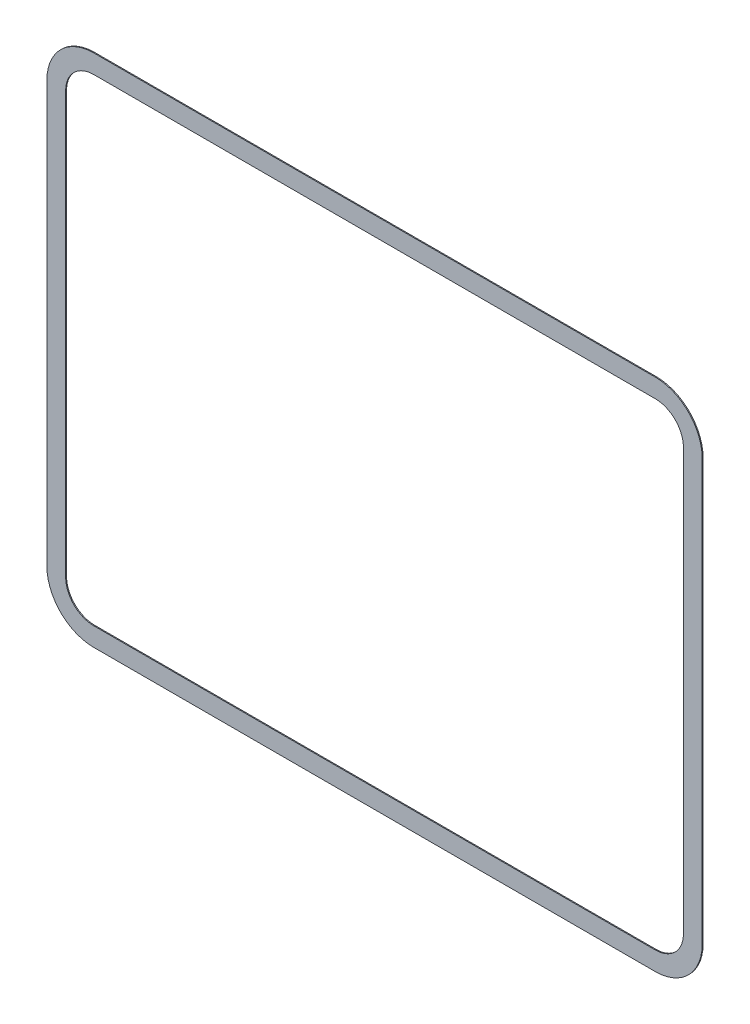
ISO-10303-21;
HEADER;
FILE_DESCRIPTION(('STEP AP214'),'2;1');
FILE_NAME('part.step','',(''),(''),'','','');
FILE_SCHEMA(('AUTOMOTIVE_DESIGN { 1 0 10303 214 1 1 1 1 }'));
ENDSEC;
DATA;
#1=APPLICATION_CONTEXT('core data for automotive mechanical design processes');
#2=APPLICATION_PROTOCOL_DEFINITION('international standard','automotive_design',2000,#1);
#3=PRODUCT_CONTEXT('',#1,'mechanical');
#4=PRODUCT('Part','Part','',(#3));
#5=PRODUCT_RELATED_PRODUCT_CATEGORY('part','',(#4));
#6=PRODUCT_DEFINITION_FORMATION('','',#4);
#7=PRODUCT_DEFINITION_CONTEXT('part definition',#1,'design');
#8=PRODUCT_DEFINITION('design','',#6,#7);
#9=PRODUCT_DEFINITION_SHAPE('','',#8);
#10=(LENGTH_UNIT() NAMED_UNIT(*) SI_UNIT(.MILLI.,.METRE.));
#11=(NAMED_UNIT(*) PLANE_ANGLE_UNIT() SI_UNIT($,.RADIAN.));
#12=(NAMED_UNIT(*) SI_UNIT($,.STERADIAN.) SOLID_ANGLE_UNIT());
#13=UNCERTAINTY_MEASURE_WITH_UNIT(LENGTH_MEASURE(1.E-05),#10,'distance_accuracy_value','');
#14=(GEOMETRIC_REPRESENTATION_CONTEXT(3) GLOBAL_UNCERTAINTY_ASSIGNED_CONTEXT((#13)) GLOBAL_UNIT_ASSIGNED_CONTEXT((#10,
#11,#12)) REPRESENTATION_CONTEXT('',''));
#15=CARTESIAN_POINT('',(0.,0.,0.));
#16=DIRECTION('',(0.,0.,1.));
#17=DIRECTION('',(1.,0.,0.));
#18=AXIS2_PLACEMENT_3D('',#15,#16,#17);
#19=CARTESIAN_POINT('',(-65.,5.,0.1));
#20=DIRECTION('',(0.,0.,1.));
#21=DIRECTION('',(1.,0.,0.));
#22=AXIS2_PLACEMENT_3D('',#19,#20,#21);
#23=PLANE('',#22);
#24=CARTESIAN_POINT('',(-65.,5.,0.1));
#25=DIRECTION('',(0.,0.,1.));
#26=DIRECTION('',(1.,0.,0.));
#27=AXIS2_PLACEMENT_3D('',#24,#25,#26);
#28=CIRCLE('',#27,5.);
#29=CARTESIAN_POINT('',(-70.,5.00000000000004,0.1));
#30=VERTEX_POINT('',#29);
#31=CARTESIAN_POINT('',(-65.,0.,0.1));
#32=VERTEX_POINT('',#31);
#33=EDGE_CURVE('E224',#30,#32,#28,.T.);
#34=ORIENTED_EDGE('',*,*,#33,.T.);
#35=DIRECTION('',(1.,0.,0.));
#36=VECTOR('',#35,1.);
#37=CARTESIAN_POINT('',(-65.,0.,0.1));
#38=LINE('',#37,#36);
#39=CARTESIAN_POINT('',(-5.00000000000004,0.,0.1));
#40=VERTEX_POINT('',#39);
#41=EDGE_CURVE('E227',#32,#40,#38,.T.);
#42=ORIENTED_EDGE('',*,*,#41,.T.);
#43=CARTESIAN_POINT('',(-5.,5.,0.1));
#44=DIRECTION('',(0.,0.,1.));
#45=DIRECTION('',(1.,0.,0.));
#46=AXIS2_PLACEMENT_3D('',#43,#44,#45);
#47=CIRCLE('',#46,5.);
#48=CARTESIAN_POINT('',(0.,5.00000000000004,0.1));
#49=VERTEX_POINT('',#48);
#50=EDGE_CURVE('E229',#40,#49,#47,.T.);
#51=ORIENTED_EDGE('',*,*,#50,.T.);
#52=DIRECTION('',(0.,1.,0.));
#53=VECTOR('',#52,1.);
#54=CARTESIAN_POINT('',(0.,50.,0.1));
#55=LINE('',#54,#53);
#56=CARTESIAN_POINT('',(0.,50.,0.1));
#57=VERTEX_POINT('',#56);
#58=EDGE_CURVE('E231',#49,#57,#55,.T.);
#59=ORIENTED_EDGE('',*,*,#58,.T.);
#60=CARTESIAN_POINT('',(-5.,50.,0.1));
#61=DIRECTION('',(0.,0.,1.));
#62=DIRECTION('',(-1.,0.,0.));
#63=AXIS2_PLACEMENT_3D('',#60,#61,#62);
#64=CIRCLE('',#63,5.);
#65=CARTESIAN_POINT('',(-5.00000000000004,55.,0.1));
#66=VERTEX_POINT('',#65);
#67=EDGE_CURVE('E233',#57,#66,#64,.T.);
#68=ORIENTED_EDGE('',*,*,#67,.T.);
#69=DIRECTION('',(-1.,0.,0.));
#70=VECTOR('',#69,1.);
#71=CARTESIAN_POINT('',(-65.,55.,0.1));
#72=LINE('',#71,#70);
#73=CARTESIAN_POINT('',(-65.,55.,0.1));
#74=VERTEX_POINT('',#73);
#75=EDGE_CURVE('E235',#66,#74,#72,.T.);
#76=ORIENTED_EDGE('',*,*,#75,.T.);
#77=CARTESIAN_POINT('',(-65.,50.,0.1));
#78=DIRECTION('',(0.,0.,1.));
#79=DIRECTION('',(1.,0.,0.));
#80=AXIS2_PLACEMENT_3D('',#77,#78,#79);
#81=CIRCLE('',#80,5.);
#82=CARTESIAN_POINT('',(-70.,50.,0.1));
#83=VERTEX_POINT('',#82);
#84=EDGE_CURVE('E237',#74,#83,#81,.T.);
#85=ORIENTED_EDGE('',*,*,#84,.T.);
#86=DIRECTION('',(0.,-1.,0.));
#87=VECTOR('',#86,1.);
#88=CARTESIAN_POINT('',(-70.,50.,0.1));
#89=LINE('',#88,#87);
#90=EDGE_CURVE('E239',#83,#30,#89,.T.);
#91=ORIENTED_EDGE('',*,*,#90,.T.);
#92=EDGE_LOOP('',(#34,#42,#51,#59,#68,#76,#85,#91));
#93=FACE_BOUND('',#92,.T.);
#94=DIRECTION('',(-1.,0.,0.));
#95=VECTOR('',#94,1.);
#96=CARTESIAN_POINT('',(-65.,53.,0.1));
#97=LINE('',#96,#95);
#98=CARTESIAN_POINT('',(-5.00000000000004,53.,0.1));
#99=VERTEX_POINT('',#98);
#100=CARTESIAN_POINT('',(-65.,53.,0.1));
#101=VERTEX_POINT('',#100);
#102=EDGE_CURVE('E182',#99,#101,#97,.T.);
#103=ORIENTED_EDGE('',*,*,#102,.F.);
#104=CARTESIAN_POINT('',(-5.,50.,0.1));
#105=DIRECTION('',(0.,0.,1.));
#106=DIRECTION('',(-1.,0.,0.));
#107=AXIS2_PLACEMENT_3D('',#104,#105,#106);
#108=CIRCLE('',#107,3.);
#109=CARTESIAN_POINT('',(-2.,50.,0.1));
#110=VERTEX_POINT('',#109);
#111=EDGE_CURVE('E159',#110,#99,#108,.T.);
#112=ORIENTED_EDGE('',*,*,#111,.F.);
#113=DIRECTION('',(0.,1.,0.));
#114=VECTOR('',#113,1.);
#115=CARTESIAN_POINT('',(-2.,50.,0.1));
#116=LINE('',#115,#114);
#117=CARTESIAN_POINT('',(-2.,5.00000000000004,0.1));
#118=VERTEX_POINT('',#117);
#119=EDGE_CURVE('E194',#118,#110,#116,.T.);
#120=ORIENTED_EDGE('',*,*,#119,.F.);
#121=CARTESIAN_POINT('',(-5.,5.,0.1));
#122=DIRECTION('',(0.,0.,1.));
#123=DIRECTION('',(1.,0.,0.));
#124=AXIS2_PLACEMENT_3D('',#121,#122,#123);
#125=CIRCLE('',#124,3.);
#126=CARTESIAN_POINT('',(-5.00000000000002,2.,0.1));
#127=VERTEX_POINT('',#126);
#128=EDGE_CURVE('E192',#127,#118,#125,.T.);
#129=ORIENTED_EDGE('',*,*,#128,.F.);
#130=DIRECTION('',(1.,0.,0.));
#131=VECTOR('',#130,1.);
#132=CARTESIAN_POINT('',(-65.,2.,0.1));
#133=LINE('',#132,#131);
#134=CARTESIAN_POINT('',(-65.,2.,0.1));
#135=VERTEX_POINT('',#134);
#136=EDGE_CURVE('E190',#135,#127,#133,.T.);
#137=ORIENTED_EDGE('',*,*,#136,.F.);
#138=CARTESIAN_POINT('',(-65.,5.,0.1));
#139=DIRECTION('',(0.,0.,1.));
#140=DIRECTION('',(1.,0.,0.));
#141=AXIS2_PLACEMENT_3D('',#138,#139,#140);
#142=CIRCLE('',#141,3.);
#143=CARTESIAN_POINT('',(-68.,5.00000000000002,0.1));
#144=VERTEX_POINT('',#143);
#145=EDGE_CURVE('E188',#144,#135,#142,.T.);
#146=ORIENTED_EDGE('',*,*,#145,.F.);
#147=DIRECTION('',(0.,-1.,0.));
#148=VECTOR('',#147,1.);
#149=CARTESIAN_POINT('',(-68.,50.,0.1));
#150=LINE('',#149,#148);
#151=CARTESIAN_POINT('',(-68.,50.,0.1));
#152=VERTEX_POINT('',#151);
#153=EDGE_CURVE('E186',#152,#144,#150,.T.);
#154=ORIENTED_EDGE('',*,*,#153,.F.);
#155=CARTESIAN_POINT('',(-65.,50.,0.1));
#156=DIRECTION('',(0.,0.,1.));
#157=DIRECTION('',(1.,0.,0.));
#158=AXIS2_PLACEMENT_3D('',#155,#156,#157);
#159=CIRCLE('',#158,3.);
#160=EDGE_CURVE('E184',#101,#152,#159,.T.);
#161=ORIENTED_EDGE('',*,*,#160,.F.);
#162=EDGE_LOOP('',(#103,#112,#120,#129,#137,#146,#154,#161));
#163=FACE_BOUND('',#162,.T.);
#164=ADVANCED_FACE('F31',(#93,#163),#23,.T.);
#165=CARTESIAN_POINT('',(-65.,5.,0.));
#166=DIRECTION('',(0.,0.,1.));
#167=DIRECTION('',(1.,0.,0.));
#168=AXIS2_PLACEMENT_3D('',#165,#166,#167);
#169=PLANE('',#168);
#170=CARTESIAN_POINT('',(-65.,5.,0.));
#171=DIRECTION('',(0.,0.,1.));
#172=DIRECTION('',(1.,0.,0.));
#173=AXIS2_PLACEMENT_3D('',#170,#171,#172);
#174=CIRCLE('',#173,5.);
#175=CARTESIAN_POINT('',(-70.,5.00000000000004,0.));
#176=VERTEX_POINT('',#175);
#177=CARTESIAN_POINT('',(-65.,0.,0.));
#178=VERTEX_POINT('',#177);
#179=EDGE_CURVE('E160',#176,#178,#174,.T.);
#180=ORIENTED_EDGE('',*,*,#179,.F.);
#181=DIRECTION('',(0.,-1.,0.));
#182=VECTOR('',#181,1.);
#183=CARTESIAN_POINT('',(-70.,50.,0.));
#184=LINE('',#183,#182);
#185=CARTESIAN_POINT('',(-70.,50.,0.));
#186=VERTEX_POINT('',#185);
#187=EDGE_CURVE('E222',#186,#176,#184,.T.);
#188=ORIENTED_EDGE('',*,*,#187,.F.);
#189=CARTESIAN_POINT('',(-65.,50.,0.));
#190=DIRECTION('',(0.,0.,1.));
#191=DIRECTION('',(1.,0.,0.));
#192=AXIS2_PLACEMENT_3D('',#189,#190,#191);
#193=CIRCLE('',#192,5.);
#194=CARTESIAN_POINT('',(-65.,55.,0.));
#195=VERTEX_POINT('',#194);
#196=EDGE_CURVE('E220',#195,#186,#193,.T.);
#197=ORIENTED_EDGE('',*,*,#196,.F.);
#198=DIRECTION('',(-1.,0.,0.));
#199=VECTOR('',#198,1.);
#200=CARTESIAN_POINT('',(-65.,55.,0.));
#201=LINE('',#200,#199);
#202=CARTESIAN_POINT('',(-5.00000000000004,55.,0.));
#203=VERTEX_POINT('',#202);
#204=EDGE_CURVE('E218',#203,#195,#201,.T.);
#205=ORIENTED_EDGE('',*,*,#204,.F.);
#206=CARTESIAN_POINT('',(-5.,50.,0.));
#207=DIRECTION('',(0.,0.,1.));
#208=DIRECTION('',(-1.,0.,0.));
#209=AXIS2_PLACEMENT_3D('',#206,#207,#208);
#210=CIRCLE('',#209,5.);
#211=CARTESIAN_POINT('',(0.,50.,0.));
#212=VERTEX_POINT('',#211);
#213=EDGE_CURVE('E216',#212,#203,#210,.T.);
#214=ORIENTED_EDGE('',*,*,#213,.F.);
#215=DIRECTION('',(0.,1.,0.));
#216=VECTOR('',#215,1.);
#217=CARTESIAN_POINT('',(0.,50.,0.));
#218=LINE('',#217,#216);
#219=CARTESIAN_POINT('',(0.,5.00000000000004,0.));
#220=VERTEX_POINT('',#219);
#221=EDGE_CURVE('E214',#220,#212,#218,.T.);
#222=ORIENTED_EDGE('',*,*,#221,.F.);
#223=CARTESIAN_POINT('',(-5.,5.,0.));
#224=DIRECTION('',(0.,0.,1.));
#225=DIRECTION('',(1.,0.,0.));
#226=AXIS2_PLACEMENT_3D('',#223,#224,#225);
#227=CIRCLE('',#226,5.);
#228=CARTESIAN_POINT('',(-5.00000000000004,0.,0.));
#229=VERTEX_POINT('',#228);
#230=EDGE_CURVE('E212',#229,#220,#227,.T.);
#231=ORIENTED_EDGE('',*,*,#230,.F.);
#232=DIRECTION('',(1.,0.,0.));
#233=VECTOR('',#232,1.);
#234=CARTESIAN_POINT('',(-65.,0.,0.));
#235=LINE('',#234,#233);
#236=EDGE_CURVE('E210',#178,#229,#235,.T.);
#237=ORIENTED_EDGE('',*,*,#236,.F.);
#238=EDGE_LOOP('',(#180,#188,#197,#205,#214,#222,#231,#237));
#239=FACE_BOUND('',#238,.T.);
#240=CARTESIAN_POINT('',(-5.,50.,0.));
#241=DIRECTION('',(0.,0.,1.));
#242=DIRECTION('',(-1.,0.,0.));
#243=AXIS2_PLACEMENT_3D('',#240,#241,#242);
#244=CIRCLE('',#243,3.);
#245=CARTESIAN_POINT('',(-2.,50.,0.));
#246=VERTEX_POINT('',#245);
#247=CARTESIAN_POINT('',(-5.00000000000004,53.,0.));
#248=VERTEX_POINT('',#247);
#249=EDGE_CURVE('E54',#246,#248,#244,.T.);
#250=ORIENTED_EDGE('',*,*,#249,.T.);
#251=DIRECTION('',(-1.,0.,0.));
#252=VECTOR('',#251,1.);
#253=CARTESIAN_POINT('',(-65.,53.,0.));
#254=LINE('',#253,#252);
#255=CARTESIAN_POINT('',(-65.,53.,0.));
#256=VERTEX_POINT('',#255);
#257=EDGE_CURVE('E146',#248,#256,#254,.T.);
#258=ORIENTED_EDGE('',*,*,#257,.T.);
#259=CARTESIAN_POINT('',(-65.,50.,0.));
#260=DIRECTION('',(0.,0.,1.));
#261=DIRECTION('',(1.,0.,0.));
#262=AXIS2_PLACEMENT_3D('',#259,#260,#261);
#263=CIRCLE('',#262,3.);
#264=CARTESIAN_POINT('',(-68.,50.,0.));
#265=VERTEX_POINT('',#264);
#266=EDGE_CURVE('E155',#256,#265,#263,.T.);
#267=ORIENTED_EDGE('',*,*,#266,.T.);
#268=DIRECTION('',(0.,-1.,0.));
#269=VECTOR('',#268,1.);
#270=CARTESIAN_POINT('',(-68.,50.,0.));
#271=LINE('',#270,#269);
#272=CARTESIAN_POINT('',(-68.,5.00000000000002,0.));
#273=VERTEX_POINT('',#272);
#274=EDGE_CURVE('E169',#265,#273,#271,.T.);
#275=ORIENTED_EDGE('',*,*,#274,.T.);
#276=CARTESIAN_POINT('',(-65.,5.,0.));
#277=DIRECTION('',(0.,0.,1.));
#278=DIRECTION('',(1.,0.,0.));
#279=AXIS2_PLACEMENT_3D('',#276,#277,#278);
#280=CIRCLE('',#279,3.);
#281=CARTESIAN_POINT('',(-65.,2.,0.));
#282=VERTEX_POINT('',#281);
#283=EDGE_CURVE('E172',#273,#282,#280,.T.);
#284=ORIENTED_EDGE('',*,*,#283,.T.);
#285=DIRECTION('',(1.,0.,0.));
#286=VECTOR('',#285,1.);
#287=CARTESIAN_POINT('',(-65.,2.,0.));
#288=LINE('',#287,#286);
#289=CARTESIAN_POINT('',(-5.00000000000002,2.,0.));
#290=VERTEX_POINT('',#289);
#291=EDGE_CURVE('E175',#282,#290,#288,.T.);
#292=ORIENTED_EDGE('',*,*,#291,.T.);
#293=CARTESIAN_POINT('',(-5.,5.,0.));
#294=DIRECTION('',(0.,0.,1.));
#295=DIRECTION('',(1.,0.,0.));
#296=AXIS2_PLACEMENT_3D('',#293,#294,#295);
#297=CIRCLE('',#296,3.);
#298=CARTESIAN_POINT('',(-2.,5.00000000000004,0.));
#299=VERTEX_POINT('',#298);
#300=EDGE_CURVE('E178',#290,#299,#297,.T.);
#301=ORIENTED_EDGE('',*,*,#300,.T.);
#302=DIRECTION('',(0.,1.,0.));
#303=VECTOR('',#302,1.);
#304=CARTESIAN_POINT('',(-2.,50.,0.));
#305=LINE('',#304,#303);
#306=EDGE_CURVE('E165',#299,#246,#305,.T.);
#307=ORIENTED_EDGE('',*,*,#306,.T.);
#308=EDGE_LOOP('',(#250,#258,#267,#275,#284,#292,#301,#307));
#309=FACE_BOUND('',#308,.T.);
#310=ADVANCED_FACE('F163',(#239,#309),#169,.F.);
#311=CARTESIAN_POINT('',(-65.,5.,0.1));
#312=DIRECTION('',(0.,0.,-1.));
#313=DIRECTION('',(-1.,0.,0.));
#314=AXIS2_PLACEMENT_3D('',#311,#312,#313);
#315=CYLINDRICAL_SURFACE('',#314,5.);
#316=ORIENTED_EDGE('',*,*,#179,.T.);
#317=DIRECTION('',(0.,0.,-1.));
#318=VECTOR('',#317,1.);
#319=CARTESIAN_POINT('',(-65.,0.,0.1));
#320=LINE('',#319,#318);
#321=EDGE_CURVE('E11',#32,#178,#320,.T.);
#322=ORIENTED_EDGE('',*,*,#321,.F.);
#323=ORIENTED_EDGE('',*,*,#33,.F.);
#324=DIRECTION('',(0.,0.,-1.));
#325=VECTOR('',#324,1.);
#326=CARTESIAN_POINT('',(-70.,5.00000000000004,0.1));
#327=LINE('',#326,#325);
#328=EDGE_CURVE('E241',#30,#176,#327,.T.);
#329=ORIENTED_EDGE('',*,*,#328,.T.);
#330=EDGE_LOOP('',(#316,#322,#323,#329));
#331=FACE_BOUND('',#330,.T.);
#332=ADVANCED_FACE('F33',(#331),#315,.T.);
#333=CARTESIAN_POINT('',(-65.,0.,0.1));
#334=DIRECTION('',(0.,1.,0.));
#335=DIRECTION('',(0.,0.,1.));
#336=AXIS2_PLACEMENT_3D('',#333,#334,#335);
#337=PLANE('',#336);
#338=ORIENTED_EDGE('',*,*,#236,.T.);
#339=DIRECTION('',(0.,0.,-1.));
#340=VECTOR('',#339,1.);
#341=CARTESIAN_POINT('',(-5.00000000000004,0.,0.1));
#342=LINE('',#341,#340);
#343=EDGE_CURVE('E39',#40,#229,#342,.T.);
#344=ORIENTED_EDGE('',*,*,#343,.F.);
#345=ORIENTED_EDGE('',*,*,#41,.F.);
#346=ORIENTED_EDGE('',*,*,#321,.T.);
#347=EDGE_LOOP('',(#338,#344,#345,#346));
#348=FACE_BOUND('',#347,.T.);
#349=ADVANCED_FACE('F285',(#348),#337,.F.);
#350=CARTESIAN_POINT('',(-5.,5.,0.1));
#351=DIRECTION('',(0.,0.,-1.));
#352=DIRECTION('',(-1.,0.,0.));
#353=AXIS2_PLACEMENT_3D('',#350,#351,#352);
#354=CYLINDRICAL_SURFACE('',#353,5.);
#355=ORIENTED_EDGE('',*,*,#230,.T.);
#356=DIRECTION('',(0.,0.,-1.));
#357=VECTOR('',#356,1.);
#358=CARTESIAN_POINT('',(0.,5.00000000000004,0.1));
#359=LINE('',#358,#357);
#360=EDGE_CURVE('E256',#49,#220,#359,.T.);
#361=ORIENTED_EDGE('',*,*,#360,.F.);
#362=ORIENTED_EDGE('',*,*,#50,.F.);
#363=ORIENTED_EDGE('',*,*,#343,.T.);
#364=EDGE_LOOP('',(#355,#361,#362,#363));
#365=FACE_BOUND('',#364,.T.);
#366=ADVANCED_FACE('F263',(#365),#354,.T.);
#367=CARTESIAN_POINT('',(0.,50.,0.1));
#368=DIRECTION('',(-1.,0.,0.));
#369=DIRECTION('',(0.,-1.,0.));
#370=AXIS2_PLACEMENT_3D('',#367,#368,#369);
#371=PLANE('',#370);
#372=ORIENTED_EDGE('',*,*,#221,.T.);
#373=DIRECTION('',(0.,0.,-1.));
#374=VECTOR('',#373,1.);
#375=CARTESIAN_POINT('',(0.,50.,0.1));
#376=LINE('',#375,#374);
#377=EDGE_CURVE('E253',#57,#212,#376,.T.);
#378=ORIENTED_EDGE('',*,*,#377,.F.);
#379=ORIENTED_EDGE('',*,*,#58,.F.);
#380=ORIENTED_EDGE('',*,*,#360,.T.);
#381=EDGE_LOOP('',(#372,#378,#379,#380));
#382=FACE_BOUND('',#381,.T.);
#383=ADVANCED_FACE('F273',(#382),#371,.F.);
#384=CARTESIAN_POINT('',(-5.,50.,0.1));
#385=DIRECTION('',(0.,0.,-1.));
#386=DIRECTION('',(-1.,0.,0.));
#387=AXIS2_PLACEMENT_3D('',#384,#385,#386);
#388=CYLINDRICAL_SURFACE('',#387,5.);
#389=ORIENTED_EDGE('',*,*,#213,.T.);
#390=DIRECTION('',(0.,0.,-1.));
#391=VECTOR('',#390,1.);
#392=CARTESIAN_POINT('',(-5.00000000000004,55.,0.1));
#393=LINE('',#392,#391);
#394=EDGE_CURVE('E250',#66,#203,#393,.T.);
#395=ORIENTED_EDGE('',*,*,#394,.F.);
#396=ORIENTED_EDGE('',*,*,#67,.F.);
#397=ORIENTED_EDGE('',*,*,#377,.T.);
#398=EDGE_LOOP('',(#389,#395,#396,#397));
#399=FACE_BOUND('',#398,.T.);
#400=ADVANCED_FACE('F277',(#399),#388,.T.);
#401=CARTESIAN_POINT('',(-65.,55.,0.1));
#402=DIRECTION('',(0.,-1.,0.));
#403=DIRECTION('',(0.,0.,-1.));
#404=AXIS2_PLACEMENT_3D('',#401,#402,#403);
#405=PLANE('',#404);
#406=ORIENTED_EDGE('',*,*,#204,.T.);
#407=DIRECTION('',(0.,0.,-1.));
#408=VECTOR('',#407,1.);
#409=CARTESIAN_POINT('',(-65.,55.,0.1));
#410=LINE('',#409,#408);
#411=EDGE_CURVE('E247',#74,#195,#410,.T.);
#412=ORIENTED_EDGE('',*,*,#411,.F.);
#413=ORIENTED_EDGE('',*,*,#75,.F.);
#414=ORIENTED_EDGE('',*,*,#394,.T.);
#415=EDGE_LOOP('',(#406,#412,#413,#414));
#416=FACE_BOUND('',#415,.T.);
#417=ADVANCED_FACE('F298',(#416),#405,.F.);
#418=CARTESIAN_POINT('',(-65.,50.,0.1));
#419=DIRECTION('',(0.,0.,-1.));
#420=DIRECTION('',(-1.,0.,0.));
#421=AXIS2_PLACEMENT_3D('',#418,#419,#420);
#422=CYLINDRICAL_SURFACE('',#421,5.);
#423=ORIENTED_EDGE('',*,*,#196,.T.);
#424=DIRECTION('',(0.,0.,-1.));
#425=VECTOR('',#424,1.);
#426=CARTESIAN_POINT('',(-70.,50.,0.1));
#427=LINE('',#426,#425);
#428=EDGE_CURVE('E244',#83,#186,#427,.T.);
#429=ORIENTED_EDGE('',*,*,#428,.F.);
#430=ORIENTED_EDGE('',*,*,#84,.F.);
#431=ORIENTED_EDGE('',*,*,#411,.T.);
#432=EDGE_LOOP('',(#423,#429,#430,#431));
#433=FACE_BOUND('',#432,.T.);
#434=ADVANCED_FACE('F296',(#433),#422,.T.);
#435=CARTESIAN_POINT('',(-70.,50.,0.1));
#436=DIRECTION('',(1.,0.,0.));
#437=DIRECTION('',(0.,0.,-1.));
#438=AXIS2_PLACEMENT_3D('',#435,#436,#437);
#439=PLANE('',#438);
#440=ORIENTED_EDGE('',*,*,#187,.T.);
#441=ORIENTED_EDGE('',*,*,#328,.F.);
#442=ORIENTED_EDGE('',*,*,#90,.F.);
#443=ORIENTED_EDGE('',*,*,#428,.T.);
#444=EDGE_LOOP('',(#440,#441,#442,#443));
#445=FACE_BOUND('',#444,.T.);
#446=ADVANCED_FACE('F291',(#445),#439,.F.);
#447=CARTESIAN_POINT('',(-5.,50.,0.1));
#448=DIRECTION('',(0.,0.,-1.));
#449=DIRECTION('',(-1.,0.,0.));
#450=AXIS2_PLACEMENT_3D('',#447,#448,#449);
#451=CYLINDRICAL_SURFACE('',#450,3.);
#452=ORIENTED_EDGE('',*,*,#249,.F.);
#453=DIRECTION('',(0.,0.,-1.));
#454=VECTOR('',#453,1.);
#455=CARTESIAN_POINT('',(-2.,50.,0.1));
#456=LINE('',#455,#454);
#457=EDGE_CURVE('E196',#110,#246,#456,.T.);
#458=ORIENTED_EDGE('',*,*,#457,.F.);
#459=ORIENTED_EDGE('',*,*,#111,.T.);
#460=DIRECTION('',(0.,0.,-1.));
#461=VECTOR('',#460,1.);
#462=CARTESIAN_POINT('',(-5.00000000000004,53.,0.1));
#463=LINE('',#462,#461);
#464=EDGE_CURVE('E148',#99,#248,#463,.T.);
#465=ORIENTED_EDGE('',*,*,#464,.T.);
#466=EDGE_LOOP('',(#452,#458,#459,#465));
#467=FACE_BOUND('',#466,.T.);
#468=ADVANCED_FACE('F157',(#467),#451,.F.);
#469=CARTESIAN_POINT('',(-65.,53.,0.1));
#470=DIRECTION('',(0.,-1.,0.));
#471=DIRECTION('',(1.,0.,0.));
#472=AXIS2_PLACEMENT_3D('',#469,#470,#471);
#473=PLANE('',#472);
#474=ORIENTED_EDGE('',*,*,#257,.F.);
#475=ORIENTED_EDGE('',*,*,#464,.F.);
#476=ORIENTED_EDGE('',*,*,#102,.T.);
#477=DIRECTION('',(0.,0.,-1.));
#478=VECTOR('',#477,1.);
#479=CARTESIAN_POINT('',(-65.,53.,0.1));
#480=LINE('',#479,#478);
#481=EDGE_CURVE('E151',#101,#256,#480,.T.);
#482=ORIENTED_EDGE('',*,*,#481,.T.);
#483=EDGE_LOOP('',(#474,#475,#476,#482));
#484=FACE_BOUND('',#483,.T.);
#485=ADVANCED_FACE('F147',(#484),#473,.T.);
#486=CARTESIAN_POINT('',(-65.,50.,0.1));
#487=DIRECTION('',(0.,0.,-1.));
#488=DIRECTION('',(-1.,0.,0.));
#489=AXIS2_PLACEMENT_3D('',#486,#487,#488);
#490=CYLINDRICAL_SURFACE('',#489,3.);
#491=ORIENTED_EDGE('',*,*,#266,.F.);
#492=ORIENTED_EDGE('',*,*,#481,.F.);
#493=ORIENTED_EDGE('',*,*,#160,.T.);
#494=DIRECTION('',(0.,0.,-1.));
#495=VECTOR('',#494,1.);
#496=CARTESIAN_POINT('',(-68.,50.,0.1));
#497=LINE('',#496,#495);
#498=EDGE_CURVE('E205',#152,#265,#497,.T.);
#499=ORIENTED_EDGE('',*,*,#498,.T.);
#500=EDGE_LOOP('',(#491,#492,#493,#499));
#501=FACE_BOUND('',#500,.T.);
#502=ADVANCED_FACE('F322',(#501),#490,.F.);
#503=CARTESIAN_POINT('',(-68.,50.,0.1));
#504=DIRECTION('',(1.,0.,0.));
#505=DIRECTION('',(0.,0.,-1.));
#506=AXIS2_PLACEMENT_3D('',#503,#504,#505);
#507=PLANE('',#506);
#508=ORIENTED_EDGE('',*,*,#274,.F.);
#509=ORIENTED_EDGE('',*,*,#498,.F.);
#510=ORIENTED_EDGE('',*,*,#153,.T.);
#511=DIRECTION('',(0.,0.,-1.));
#512=VECTOR('',#511,1.);
#513=CARTESIAN_POINT('',(-68.,5.00000000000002,0.1));
#514=LINE('',#513,#512);
#515=EDGE_CURVE('E203',#144,#273,#514,.T.);
#516=ORIENTED_EDGE('',*,*,#515,.T.);
#517=EDGE_LOOP('',(#508,#509,#510,#516));
#518=FACE_BOUND('',#517,.T.);
#519=ADVANCED_FACE('F327',(#518),#507,.T.);
#520=CARTESIAN_POINT('',(-65.,5.,0.1));
#521=DIRECTION('',(0.,0.,-1.));
#522=DIRECTION('',(-1.,0.,0.));
#523=AXIS2_PLACEMENT_3D('',#520,#521,#522);
#524=CYLINDRICAL_SURFACE('',#523,3.);
#525=ORIENTED_EDGE('',*,*,#283,.F.);
#526=ORIENTED_EDGE('',*,*,#515,.F.);
#527=ORIENTED_EDGE('',*,*,#145,.T.);
#528=DIRECTION('',(0.,0.,-1.));
#529=VECTOR('',#528,1.);
#530=CARTESIAN_POINT('',(-65.,2.,0.1));
#531=LINE('',#530,#529);
#532=EDGE_CURVE('E201',#135,#282,#531,.T.);
#533=ORIENTED_EDGE('',*,*,#532,.T.);
#534=EDGE_LOOP('',(#525,#526,#527,#533));
#535=FACE_BOUND('',#534,.T.);
#536=ADVANCED_FACE('F331',(#535),#524,.F.);
#537=CARTESIAN_POINT('',(-65.,2.,0.1));
#538=DIRECTION('',(0.,1.,0.));
#539=DIRECTION('',(0.,0.,1.));
#540=AXIS2_PLACEMENT_3D('',#537,#538,#539);
#541=PLANE('',#540);
#542=ORIENTED_EDGE('',*,*,#291,.F.);
#543=ORIENTED_EDGE('',*,*,#532,.F.);
#544=ORIENTED_EDGE('',*,*,#136,.T.);
#545=DIRECTION('',(0.,0.,-1.));
#546=VECTOR('',#545,1.);
#547=CARTESIAN_POINT('',(-5.00000000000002,2.,0.1));
#548=LINE('',#547,#546);
#549=EDGE_CURVE('E199',#127,#290,#548,.T.);
#550=ORIENTED_EDGE('',*,*,#549,.T.);
#551=EDGE_LOOP('',(#542,#543,#544,#550));
#552=FACE_BOUND('',#551,.T.);
#553=ADVANCED_FACE('F335',(#552),#541,.T.);
#554=CARTESIAN_POINT('',(-5.,5.,0.1));
#555=DIRECTION('',(0.,0.,-1.));
#556=DIRECTION('',(-1.,0.,0.));
#557=AXIS2_PLACEMENT_3D('',#554,#555,#556);
#558=CYLINDRICAL_SURFACE('',#557,3.);
#559=ORIENTED_EDGE('',*,*,#300,.F.);
#560=ORIENTED_EDGE('',*,*,#549,.F.);
#561=ORIENTED_EDGE('',*,*,#128,.T.);
#562=DIRECTION('',(0.,0.,-1.));
#563=VECTOR('',#562,1.);
#564=CARTESIAN_POINT('',(-2.,5.00000000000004,0.1));
#565=LINE('',#564,#563);
#566=EDGE_CURVE('E46',#118,#299,#565,.T.);
#567=ORIENTED_EDGE('',*,*,#566,.T.);
#568=EDGE_LOOP('',(#559,#560,#561,#567));
#569=FACE_BOUND('',#568,.T.);
#570=ADVANCED_FACE('F339',(#569),#558,.F.);
#571=CARTESIAN_POINT('',(-2.,50.,0.1));
#572=DIRECTION('',(-1.,0.,0.));
#573=DIRECTION('',(0.,0.,1.));
#574=AXIS2_PLACEMENT_3D('',#571,#572,#573);
#575=PLANE('',#574);
#576=ORIENTED_EDGE('',*,*,#306,.F.);
#577=ORIENTED_EDGE('',*,*,#566,.F.);
#578=ORIENTED_EDGE('',*,*,#119,.T.);
#579=ORIENTED_EDGE('',*,*,#457,.T.);
#580=EDGE_LOOP('',(#576,#577,#578,#579));
#581=FACE_BOUND('',#580,.T.);
#582=ADVANCED_FACE('F343',(#581),#575,.T.);
#583=CLOSED_SHELL('',(#164,#310,#332,#349,#366,#383,#400,#417,#434,#446,#468,#485,#502,#519,
#536,#553,#570,#582));
#584=MANIFOLD_SOLID_BREP('B2',#583);
#585=ADVANCED_BREP_SHAPE_REPRESENTATION('',(#18,#584),#14);
#586=SHAPE_DEFINITION_REPRESENTATION(#9,#585);
ENDSEC;
END-ISO-10303-21;
